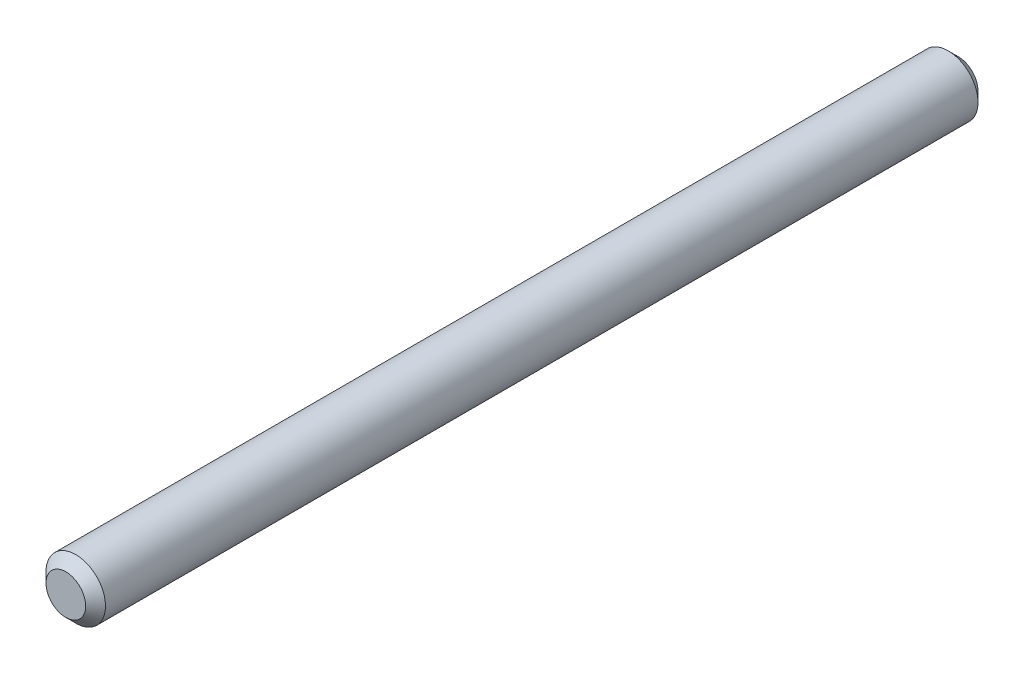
ISO-10303-21;
HEADER;
FILE_DESCRIPTION(('STEP AP214'),'2;1');
FILE_NAME('part.step','',(''),(''),'','','');
FILE_SCHEMA(('AUTOMOTIVE_DESIGN { 1 0 10303 214 1 1 1 1 }'));
ENDSEC;
DATA;
#1=APPLICATION_CONTEXT('core data for automotive mechanical design processes');
#2=APPLICATION_PROTOCOL_DEFINITION('international standard','automotive_design',2000,#1);
#3=PRODUCT_CONTEXT('',#1,'mechanical');
#4=PRODUCT('Part','Part','',(#3));
#5=PRODUCT_RELATED_PRODUCT_CATEGORY('part','',(#4));
#6=PRODUCT_DEFINITION_FORMATION('','',#4);
#7=PRODUCT_DEFINITION_CONTEXT('part definition',#1,'design');
#8=PRODUCT_DEFINITION('design','',#6,#7);
#9=PRODUCT_DEFINITION_SHAPE('','',#8);
#10=(LENGTH_UNIT() NAMED_UNIT(*) SI_UNIT(.MILLI.,.METRE.));
#11=(NAMED_UNIT(*) PLANE_ANGLE_UNIT() SI_UNIT($,.RADIAN.));
#12=(NAMED_UNIT(*) SI_UNIT($,.STERADIAN.) SOLID_ANGLE_UNIT());
#13=UNCERTAINTY_MEASURE_WITH_UNIT(LENGTH_MEASURE(1.E-05),#10,'distance_accuracy_value','');
#14=(GEOMETRIC_REPRESENTATION_CONTEXT(3) GLOBAL_UNCERTAINTY_ASSIGNED_CONTEXT((#13)) GLOBAL_UNIT_ASSIGNED_CONTEXT((#10,
#11,#12)) REPRESENTATION_CONTEXT('',''));
#15=CARTESIAN_POINT('',(0.,0.,0.));
#16=DIRECTION('',(0.,0.,1.));
#17=DIRECTION('',(1.,0.,0.));
#18=AXIS2_PLACEMENT_3D('',#15,#16,#17);
#19=CARTESIAN_POINT('',(0.,0.,45.));
#20=DIRECTION('',(0.,0.,-1.));
#21=DIRECTION('',(-1.,0.,0.));
#22=AXIS2_PLACEMENT_3D('',#19,#20,#21);
#23=CYLINDRICAL_SURFACE('',#22,1.5);
#24=CARTESIAN_POINT('',(0.,0.,0.500000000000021));
#25=DIRECTION('',(0.,0.,1.));
#26=DIRECTION('',(1.,0.,0.));
#27=AXIS2_PLACEMENT_3D('',#24,#25,#26);
#28=CIRCLE('',#27,1.5);
#29=CARTESIAN_POINT('',(-1.5,0.,0.500000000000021));
#30=VERTEX_POINT('',#29);
#31=EDGE_CURVE('E44',#30,#30,#28,.T.);
#32=CARTESIAN_POINT('',(0.,0.,44.5));
#33=DIRECTION('',(0.,0.,1.));
#34=DIRECTION('',(1.,0.,0.));
#35=AXIS2_PLACEMENT_3D('',#32,#33,#34);
#36=CIRCLE('',#35,1.5);
#37=CARTESIAN_POINT('',(-1.5,0.,44.5));
#38=VERTEX_POINT('',#37);
#39=EDGE_CURVE('E48',#38,#38,#36,.F.);
#40=CARTESIAN_POINT('',(-1.5,0.,0.500000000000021));
#41=CARTESIAN_POINT('',(-1.5,0.,0.958333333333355));
#42=CARTESIAN_POINT('',(-1.5,0.,1.41666666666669));
#43=CARTESIAN_POINT('',(-1.5,0.,2.33333333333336));
#44=CARTESIAN_POINT('',(-1.5,0.,2.79166666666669));
#45=CARTESIAN_POINT('',(-1.5,0.,3.70833333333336));
#46=CARTESIAN_POINT('',(-1.5,0.,4.16666666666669));
#47=CARTESIAN_POINT('',(-1.5,0.,5.08333333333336));
#48=CARTESIAN_POINT('',(-1.5,0.,5.54166666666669));
#49=CARTESIAN_POINT('',(-1.5,0.,6.45833333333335));
#50=CARTESIAN_POINT('',(-1.5,0.,6.91666666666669));
#51=CARTESIAN_POINT('',(-1.5,0.,7.83333333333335));
#52=CARTESIAN_POINT('',(-1.5,0.,8.29166666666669));
#53=CARTESIAN_POINT('',(-1.5,0.,9.20833333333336));
#54=CARTESIAN_POINT('',(-1.5,0.,9.66666666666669));
#55=CARTESIAN_POINT('',(-1.5,0.,10.5833333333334));
#56=CARTESIAN_POINT('',(-1.5,0.,11.0416666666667));
#57=CARTESIAN_POINT('',(-1.5,0.,11.9583333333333));
#58=CARTESIAN_POINT('',(-1.5,0.,12.4166666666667));
#59=CARTESIAN_POINT('',(-1.5,0.,13.3333333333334));
#60=CARTESIAN_POINT('',(-1.5,0.,13.7916666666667));
#61=CARTESIAN_POINT('',(-1.5,0.,14.7083333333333));
#62=CARTESIAN_POINT('',(-1.5,0.,15.1666666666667));
#63=CARTESIAN_POINT('',(-1.5,0.,16.0833333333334));
#64=CARTESIAN_POINT('',(-1.5,0.,16.5416666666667));
#65=CARTESIAN_POINT('',(-1.5,0.,17.4583333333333));
#66=CARTESIAN_POINT('',(-1.5,0.,17.9166666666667));
#67=CARTESIAN_POINT('',(-1.5,0.,18.8333333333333));
#68=CARTESIAN_POINT('',(-1.5,0.,19.2916666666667));
#69=CARTESIAN_POINT('',(-1.5,0.,20.2083333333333));
#70=CARTESIAN_POINT('',(-1.5,0.,20.6666666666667));
#71=CARTESIAN_POINT('',(-1.5,0.,21.5833333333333));
#72=CARTESIAN_POINT('',(-1.5,0.,22.0416666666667));
#73=CARTESIAN_POINT('',(-1.5,0.,22.9583333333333));
#74=CARTESIAN_POINT('',(-1.5,0.,23.4166666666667));
#75=CARTESIAN_POINT('',(-1.5,0.,24.3333333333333));
#76=CARTESIAN_POINT('',(-1.5,0.,24.7916666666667));
#77=CARTESIAN_POINT('',(-1.5,0.,25.7083333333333));
#78=CARTESIAN_POINT('',(-1.5,0.,26.1666666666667));
#79=CARTESIAN_POINT('',(-1.5,0.,27.0833333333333));
#80=CARTESIAN_POINT('',(-1.5,0.,27.5416666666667));
#81=CARTESIAN_POINT('',(-1.5,0.,28.4583333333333));
#82=CARTESIAN_POINT('',(-1.5,0.,28.9166666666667));
#83=CARTESIAN_POINT('',(-1.5,0.,29.8333333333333));
#84=CARTESIAN_POINT('',(-1.5,0.,30.2916666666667));
#85=CARTESIAN_POINT('',(-1.5,0.,31.2083333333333));
#86=CARTESIAN_POINT('',(-1.5,0.,31.6666666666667));
#87=CARTESIAN_POINT('',(-1.5,0.,32.5833333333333));
#88=CARTESIAN_POINT('',(-1.5,0.,33.0416666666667));
#89=CARTESIAN_POINT('',(-1.5,0.,33.9583333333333));
#90=CARTESIAN_POINT('',(-1.5,0.,34.4166666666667));
#91=CARTESIAN_POINT('',(-1.5,0.,35.3333333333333));
#92=CARTESIAN_POINT('',(-1.5,0.,35.7916666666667));
#93=CARTESIAN_POINT('',(-1.5,0.,36.7083333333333));
#94=CARTESIAN_POINT('',(-1.5,0.,37.1666666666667));
#95=CARTESIAN_POINT('',(-1.5,0.,38.0833333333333));
#96=CARTESIAN_POINT('',(-1.5,0.,38.5416666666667));
#97=CARTESIAN_POINT('',(-1.5,0.,39.4583333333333));
#98=CARTESIAN_POINT('',(-1.5,0.,39.9166666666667));
#99=CARTESIAN_POINT('',(-1.5,0.,40.8333333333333));
#100=CARTESIAN_POINT('',(-1.5,0.,41.2916666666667));
#101=CARTESIAN_POINT('',(-1.5,0.,42.2083333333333));
#102=CARTESIAN_POINT('',(-1.5,0.,42.6666666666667));
#103=CARTESIAN_POINT('',(-1.5,0.,43.5833333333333));
#104=CARTESIAN_POINT('',(-1.5,0.,44.0416666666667));
#105=CARTESIAN_POINT('',(-1.5,0.,44.5));
#106=B_SPLINE_CURVE_WITH_KNOTS('',3,(#40,#41,#42,#43,#44,#45,#46,#47,#48,#49,#50,#51,#52,#53,
#54,#55,#56,#57,#58,#59,#60,#61,#62,#63,#64,#65,#66,#67,#68,#69,#70,#71,#72,#73,#74,#75,#76,#77,
#78,#79,#80,#81,#82,#83,#84,#85,#86,#87,#88,#89,#90,#91,#92,#93,#94,#95,#96,#97,#98,#99,#100,
#101,#102,#103,#104,#105),.UNSPECIFIED.,.F.,.F.,(4,2,2,2,2,2,2,2,2,2,2,2,2,2,2,2,2,2,2,2,2,2,2,
2,2,2,2,2,2,2,2,2,4),(0.,1.375,2.75,4.125,5.5,6.875,8.25,9.625,11.,12.375,13.75,15.125,16.5,
17.875,19.25,20.625,22.,23.375,24.75,26.125,27.5,28.875,30.25,31.625,33.,34.375,35.75,37.125,
38.5,39.875,41.25,42.625,44.),.UNSPECIFIED.);
#107=EDGE_CURVE('BSEAM33',#30,#38,#106,.T.);
#108=ORIENTED_EDGE('',*,*,#31,.T.);
#109=ORIENTED_EDGE('',*,*,#39,.T.);
#110=ORIENTED_EDGE('',*,*,#107,.T.);
#111=ORIENTED_EDGE('',*,*,#107,.F.);
#112=EDGE_LOOP('',(#108,#110,#109,#111));
#113=FACE_BOUND('',#112,.T.);
#114=ADVANCED_FACE('F33',(#113),#23,.T.);
#115=CARTESIAN_POINT('',(0.,0.,45.));
#116=DIRECTION('',(0.,0.,1.));
#117=DIRECTION('',(1.,0.,0.));
#118=AXIS2_PLACEMENT_3D('',#115,#116,#117);
#119=PLANE('',#118);
#120=CARTESIAN_POINT('',(0.,0.,45.));
#121=DIRECTION('',(0.,0.,1.));
#122=DIRECTION('',(1.,0.,0.));
#123=AXIS2_PLACEMENT_3D('',#120,#121,#122);
#124=CIRCLE('',#123,1.00000000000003);
#125=CARTESIAN_POINT('',(1.00000000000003,0.,45.));
#126=VERTEX_POINT('',#125);
#127=EDGE_CURVE('E10',#126,#126,#124,.T.);
#128=ORIENTED_EDGE('',*,*,#127,.T.);
#129=EDGE_LOOP('',(#128));
#130=FACE_BOUND('',#129,.T.);
#131=ADVANCED_FACE('F64',(#130),#119,.T.);
#132=CARTESIAN_POINT('',(0.,0.,0.));
#133=DIRECTION('',(0.,0.,1.));
#134=DIRECTION('',(1.,0.,0.));
#135=AXIS2_PLACEMENT_3D('',#132,#133,#134);
#136=PLANE('',#135);
#137=CARTESIAN_POINT('',(0.,0.,0.));
#138=DIRECTION('',(0.,0.,1.));
#139=DIRECTION('',(1.,0.,0.));
#140=AXIS2_PLACEMENT_3D('',#137,#138,#139);
#141=CIRCLE('',#140,0.999999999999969);
#142=CARTESIAN_POINT('',(0.999999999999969,0.,0.));
#143=VERTEX_POINT('',#142);
#144=EDGE_CURVE('E40',#143,#143,#141,.F.);
#145=ORIENTED_EDGE('',*,*,#144,.T.);
#146=EDGE_LOOP('',(#145));
#147=FACE_BOUND('',#146,.T.);
#148=ADVANCED_FACE('F61',(#147),#136,.F.);
#149=CARTESIAN_POINT('',(0.,0.,0.500000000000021));
#150=DIRECTION('',(0.,0.,1.));
#151=DIRECTION('',(1.,0.,0.));
#152=AXIS2_PLACEMENT_3D('',#149,#150,#151);
#153=CONICAL_SURFACE('',#152,1.5,0.785398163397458);
#154=ORIENTED_EDGE('',*,*,#144,.F.);
#155=EDGE_LOOP('',(#154));
#156=FACE_BOUND('',#155,.T.);
#157=ORIENTED_EDGE('',*,*,#31,.F.);
#158=EDGE_LOOP('',(#157));
#159=FACE_BOUND('',#158,.T.);
#160=ADVANCED_FACE('F57',(#156,#159),#153,.T.);
#161=CARTESIAN_POINT('',(0.,0.,45.));
#162=DIRECTION('',(0.,0.,-1.));
#163=DIRECTION('',(-1.,0.,0.));
#164=AXIS2_PLACEMENT_3D('',#161,#162,#163);
#165=CONICAL_SURFACE('',#164,1.00000000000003,0.785398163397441);
#166=ORIENTED_EDGE('',*,*,#39,.F.);
#167=EDGE_LOOP('',(#166));
#168=FACE_BOUND('',#167,.T.);
#169=ORIENTED_EDGE('',*,*,#127,.F.);
#170=EDGE_LOOP('',(#169));
#171=FACE_BOUND('',#170,.T.);
#172=ADVANCED_FACE('F35',(#168,#171),#165,.T.);
#173=CLOSED_SHELL('',(#114,#131,#148,#160,#172));
#174=MANIFOLD_SOLID_BREP('B2',#173);
#175=ADVANCED_BREP_SHAPE_REPRESENTATION('',(#18,#174),#14);
#176=SHAPE_DEFINITION_REPRESENTATION(#9,#175);
ENDSEC;
END-ISO-10303-21;
